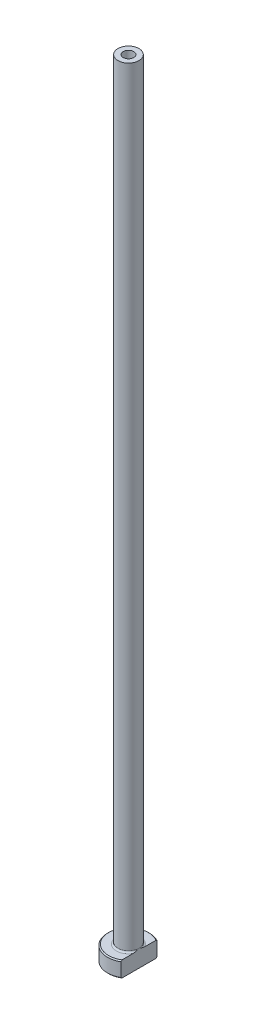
ISO-10303-21;
HEADER;
FILE_DESCRIPTION(('STEP AP214'),'2;1');
FILE_NAME('part.step','',(''),(''),'','','');
FILE_SCHEMA(('AUTOMOTIVE_DESIGN { 1 0 10303 214 1 1 1 1 }'));
ENDSEC;
DATA;
#1=APPLICATION_CONTEXT('core data for automotive mechanical design processes');
#2=APPLICATION_PROTOCOL_DEFINITION('international standard','automotive_design',2000,#1);
#3=PRODUCT_CONTEXT('',#1,'mechanical');
#4=PRODUCT('Part','Part','',(#3));
#5=PRODUCT_RELATED_PRODUCT_CATEGORY('part','',(#4));
#6=PRODUCT_DEFINITION_FORMATION('','',#4);
#7=PRODUCT_DEFINITION_CONTEXT('part definition',#1,'design');
#8=PRODUCT_DEFINITION('design','',#6,#7);
#9=PRODUCT_DEFINITION_SHAPE('','',#8);
#10=(LENGTH_UNIT() NAMED_UNIT(*) SI_UNIT(.MILLI.,.METRE.));
#11=(NAMED_UNIT(*) PLANE_ANGLE_UNIT() SI_UNIT($,.RADIAN.));
#12=(NAMED_UNIT(*) SI_UNIT($,.STERADIAN.) SOLID_ANGLE_UNIT());
#13=UNCERTAINTY_MEASURE_WITH_UNIT(LENGTH_MEASURE(1.E-05),#10,'distance_accuracy_value','');
#14=(GEOMETRIC_REPRESENTATION_CONTEXT(3) GLOBAL_UNCERTAINTY_ASSIGNED_CONTEXT((#13)) GLOBAL_UNIT_ASSIGNED_CONTEXT((#10,
#11,#12)) REPRESENTATION_CONTEXT('',''));
#15=CARTESIAN_POINT('',(0.,0.,0.));
#16=DIRECTION('',(0.,0.,1.));
#17=DIRECTION('',(1.,0.,0.));
#18=AXIS2_PLACEMENT_3D('',#15,#16,#17);
#19=CARTESIAN_POINT('',(0.,92.1876809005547,0.));
#20=DIRECTION('',(0.,1.,0.));
#21=DIRECTION('',(0.,0.,1.));
#22=AXIS2_PLACEMENT_3D('',#19,#20,#21);
#23=CYLINDRICAL_SURFACE('',#22,1.);
#24=CARTESIAN_POINT('',(0.,150.,0.));
#25=DIRECTION('',(0.,1.,0.));
#26=DIRECTION('',(0.,0.,1.));
#27=AXIS2_PLACEMENT_3D('',#24,#25,#26);
#28=CIRCLE('',#27,1.);
#29=CARTESIAN_POINT('',(0.,150.,1.));
#30=VERTEX_POINT('',#29);
#31=EDGE_CURVE('E167',#30,#30,#28,.T.);
#32=ORIENTED_EDGE('',*,*,#31,.T.);
#33=EDGE_LOOP('',(#32));
#34=FACE_BOUND('',#33,.T.);
#35=CARTESIAN_POINT('',(0.,115.,0.));
#36=DIRECTION('',(0.,1.,0.));
#37=DIRECTION('',(0.,0.,1.));
#38=AXIS2_PLACEMENT_3D('',#35,#36,#37);
#39=CIRCLE('',#38,1.);
#40=CARTESIAN_POINT('',(0.,115.,1.));
#41=VERTEX_POINT('',#40);
#42=EDGE_CURVE('E170',#41,#41,#39,.T.);
#43=ORIENTED_EDGE('',*,*,#42,.F.);
#44=EDGE_LOOP('',(#43));
#45=FACE_BOUND('',#44,.T.);
#46=ADVANCED_FACE('F32',(#34,#45),#23,.F.);
#47=CARTESIAN_POINT('',(-1.,150.,0.));
#48=DIRECTION('',(0.,1.,0.));
#49=DIRECTION('',(0.,0.,1.));
#50=AXIS2_PLACEMENT_3D('',#47,#48,#49);
#51=PLANE('',#50);
#52=CARTESIAN_POINT('',(0.,150.,0.));
#53=DIRECTION('',(0.,1.,0.));
#54=DIRECTION('',(0.,0.,1.));
#55=AXIS2_PLACEMENT_3D('',#52,#53,#54);
#56=CIRCLE('',#55,2.00000000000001);
#57=CARTESIAN_POINT('',(0.,150.,2.00000000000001));
#58=VERTEX_POINT('',#57);
#59=EDGE_CURVE('E174',#58,#58,#56,.T.);
#60=ORIENTED_EDGE('',*,*,#59,.T.);
#61=EDGE_LOOP('',(#60));
#62=FACE_BOUND('',#61,.T.);
#63=ORIENTED_EDGE('',*,*,#31,.F.);
#64=EDGE_LOOP('',(#63));
#65=FACE_BOUND('',#64,.T.);
#66=ADVANCED_FACE('F157',(#62,#65),#51,.T.);
#67=CARTESIAN_POINT('',(0.,92.1876809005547,0.));
#68=DIRECTION('',(0.,1.,0.));
#69=DIRECTION('',(0.,0.,1.));
#70=AXIS2_PLACEMENT_3D('',#67,#68,#69);
#71=CYLINDRICAL_SURFACE('',#70,2.);
#72=CARTESIAN_POINT('',(0.,3.3,0.));
#73=DIRECTION('',(0.,1.,0.));
#74=DIRECTION('',(0.,0.,1.));
#75=AXIS2_PLACEMENT_3D('',#72,#73,#74);
#76=CIRCLE('',#75,2.);
#77=CARTESIAN_POINT('',(2.,3.3,0.));
#78=VERTEX_POINT('',#77);
#79=EDGE_CURVE('E180',#78,#78,#76,.T.);
#80=ORIENTED_EDGE('',*,*,#79,.T.);
#81=EDGE_LOOP('',(#80));
#82=FACE_BOUND('',#81,.T.);
#83=ORIENTED_EDGE('',*,*,#59,.F.);
#84=EDGE_LOOP('',(#83));
#85=FACE_BOUND('',#84,.T.);
#86=ADVANCED_FACE('F162',(#82,#85),#71,.T.);
#87=CARTESIAN_POINT('',(-1.99999999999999,3.,0.));
#88=DIRECTION('',(0.,1.,0.));
#89=DIRECTION('',(0.,0.,1.));
#90=AXIS2_PLACEMENT_3D('',#87,#88,#89);
#91=PLANE('',#90);
#92=DIRECTION('',(0.,0.,1.));
#93=VECTOR('',#92,1.);
#94=CARTESIAN_POINT('',(2.,3.,0.));
#95=LINE('',#94,#93);
#96=CARTESIAN_POINT('',(2.,3.,-3.23109888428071));
#97=VERTEX_POINT('',#96);
#98=CARTESIAN_POINT('',(2.,3.,-1.13578166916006));
#99=VERTEX_POINT('',#98);
#100=EDGE_CURVE('E54',#97,#99,#95,.T.);
#101=ORIENTED_EDGE('',*,*,#100,.F.);
#102=CARTESIAN_POINT('',(0.,3.,0.));
#103=DIRECTION('',(0.,1.,0.));
#104=DIRECTION('',(0.,0.,1.));
#105=AXIS2_PLACEMENT_3D('',#102,#103,#104);
#106=CIRCLE('',#105,3.8);
#107=CARTESIAN_POINT('',(1.99999999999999,2.99999999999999,3.23109888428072));
#108=VERTEX_POINT('',#107);
#109=EDGE_CURVE('E186',#97,#108,#106,.T.);
#110=ORIENTED_EDGE('',*,*,#109,.T.);
#111=CARTESIAN_POINT('',(2.,3.,1.13578166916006));
#112=VERTEX_POINT('',#111);
#113=EDGE_CURVE('E134',#112,#108,#95,.T.);
#114=ORIENTED_EDGE('',*,*,#113,.F.);
#115=CARTESIAN_POINT('',(0.,3.,0.));
#116=DIRECTION('',(0.,1.,0.));
#117=DIRECTION('',(0.,0.,1.));
#118=AXIS2_PLACEMENT_3D('',#115,#116,#117);
#119=CIRCLE('',#118,2.3);
#120=EDGE_CURVE('E183',#112,#99,#119,.F.);
#121=ORIENTED_EDGE('',*,*,#120,.T.);
#122=EDGE_LOOP('',(#101,#110,#114,#121));
#123=FACE_BOUND('',#122,.T.);
#124=ADVANCED_FACE('F197',(#123),#91,.T.);
#125=CARTESIAN_POINT('',(0.,92.1876809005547,0.));
#126=DIRECTION('',(0.,1.,0.));
#127=DIRECTION('',(0.,0.,1.));
#128=AXIS2_PLACEMENT_3D('',#125,#126,#127);
#129=CYLINDRICAL_SURFACE('',#128,3.99999999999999);
#130=DIRECTION('',(0.,-1.,0.));
#131=VECTOR('',#130,1.);
#132=CARTESIAN_POINT('',(1.99999999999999,150.,3.46410161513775));
#133=LINE('',#132,#131);
#134=CARTESIAN_POINT('',(1.99999999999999,2.8,3.46410161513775));
#135=VERTEX_POINT('',#134);
#136=CARTESIAN_POINT('',(1.99999999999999,0.20000000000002,3.46410161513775));
#137=VERTEX_POINT('',#136);
#138=EDGE_CURVE('E82',#135,#137,#133,.T.);
#139=ORIENTED_EDGE('',*,*,#138,.F.);
#140=CARTESIAN_POINT('',(0.,2.8,0.));
#141=DIRECTION('',(0.,1.,0.));
#142=DIRECTION('',(0.,0.,1.));
#143=AXIS2_PLACEMENT_3D('',#140,#141,#142);
#144=CIRCLE('',#143,3.99999999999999);
#145=CARTESIAN_POINT('',(2.,2.8,-3.46410161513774));
#146=VERTEX_POINT('',#145);
#147=EDGE_CURVE('E95',#135,#146,#144,.F.);
#148=ORIENTED_EDGE('',*,*,#147,.T.);
#149=DIRECTION('',(0.,-1.,0.));
#150=VECTOR('',#149,1.);
#151=CARTESIAN_POINT('',(2.,150.,-3.46410161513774));
#152=LINE('',#151,#150);
#153=CARTESIAN_POINT('',(2.,0.20000000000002,-3.46410161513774));
#154=VERTEX_POINT('',#153);
#155=EDGE_CURVE('E192',#146,#154,#152,.T.);
#156=ORIENTED_EDGE('',*,*,#155,.T.);
#157=CARTESIAN_POINT('',(0.,0.20000000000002,0.));
#158=DIRECTION('',(0.,-1.,0.));
#159=DIRECTION('',(0.,0.,-1.));
#160=AXIS2_PLACEMENT_3D('',#157,#158,#159);
#161=CIRCLE('',#160,3.99999999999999);
#162=EDGE_CURVE('E98',#154,#137,#161,.F.);
#163=ORIENTED_EDGE('',*,*,#162,.T.);
#164=EDGE_LOOP('',(#139,#148,#156,#163));
#165=FACE_BOUND('',#164,.T.);
#166=ADVANCED_FACE('F190',(#165),#129,.T.);
#167=CARTESIAN_POINT('',(-3.99999999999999,0.,0.));
#168=DIRECTION('',(0.,-1.,0.));
#169=DIRECTION('',(0.,0.,-1.));
#170=AXIS2_PLACEMENT_3D('',#167,#168,#169);
#171=PLANE('',#170);
#172=CARTESIAN_POINT('',(0.,0.,0.));
#173=DIRECTION('',(0.,-1.,0.));
#174=DIRECTION('',(0.,0.,-1.));
#175=AXIS2_PLACEMENT_3D('',#172,#173,#174);
#176=CIRCLE('',#175,1.74999999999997);
#177=CARTESIAN_POINT('',(0.,0.,-1.74999999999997));
#178=VERTEX_POINT('',#177);
#179=EDGE_CURVE('E40',#178,#178,#176,.F.);
#180=ORIENTED_EDGE('',*,*,#179,.T.);
#181=EDGE_LOOP('',(#180));
#182=FACE_BOUND('',#181,.T.);
#183=DIRECTION('',(0.,0.,-1.));
#184=VECTOR('',#183,1.);
#185=CARTESIAN_POINT('',(1.99999999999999,0.,3.46410161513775));
#186=LINE('',#185,#184);
#187=CARTESIAN_POINT('',(1.99999999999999,0.,3.23109888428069));
#188=VERTEX_POINT('',#187);
#189=CARTESIAN_POINT('',(2.,0.,-3.23109888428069));
#190=VERTEX_POINT('',#189);
#191=EDGE_CURVE('E47',#188,#190,#186,.T.);
#192=ORIENTED_EDGE('',*,*,#191,.F.);
#193=CARTESIAN_POINT('',(0.,0.,0.));
#194=DIRECTION('',(0.,-1.,0.));
#195=DIRECTION('',(0.,0.,-1.));
#196=AXIS2_PLACEMENT_3D('',#193,#194,#195);
#197=CIRCLE('',#196,3.79999999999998);
#198=EDGE_CURVE('E92',#188,#190,#197,.T.);
#199=ORIENTED_EDGE('',*,*,#198,.T.);
#200=EDGE_LOOP('',(#192,#199));
#201=FACE_BOUND('',#200,.T.);
#202=ADVANCED_FACE('F91',(#182,#201),#171,.T.);
#203=CARTESIAN_POINT('',(0.,92.1876809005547,0.));
#204=DIRECTION('',(0.,1.,0.));
#205=DIRECTION('',(0.,0.,1.));
#206=AXIS2_PLACEMENT_3D('',#203,#204,#205);
#207=CYLINDRICAL_SURFACE('',#206,1.25);
#208=CARTESIAN_POINT('',(0.,0.499999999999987,0.));
#209=DIRECTION('',(0.,-1.,0.));
#210=DIRECTION('',(0.,0.,-1.));
#211=AXIS2_PLACEMENT_3D('',#208,#209,#210);
#212=CIRCLE('',#211,1.25);
#213=CARTESIAN_POINT('',(0.,0.499999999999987,-1.25));
#214=VERTEX_POINT('',#213);
#215=EDGE_CURVE('E11',#214,#214,#212,.T.);
#216=ORIENTED_EDGE('',*,*,#215,.T.);
#217=EDGE_LOOP('',(#216));
#218=FACE_BOUND('',#217,.T.);
#219=CARTESIAN_POINT('',(0.,103.,0.));
#220=DIRECTION('',(0.,1.,0.));
#221=DIRECTION('',(0.,0.,1.));
#222=AXIS2_PLACEMENT_3D('',#219,#220,#221);
#223=CIRCLE('',#222,1.25);
#224=CARTESIAN_POINT('',(0.,103.,1.25));
#225=VERTEX_POINT('',#224);
#226=EDGE_CURVE('E172',#225,#225,#223,.T.);
#227=ORIENTED_EDGE('',*,*,#226,.T.);
#228=EDGE_LOOP('',(#227));
#229=FACE_BOUND('',#228,.T.);
#230=ADVANCED_FACE('F215',(#218,#229),#207,.F.);
#231=CARTESIAN_POINT('',(0.,103.,0.));
#232=DIRECTION('',(0.,-1.,0.));
#233=DIRECTION('',(0.,0.,-1.));
#234=AXIS2_PLACEMENT_3D('',#231,#232,#233);
#235=CONICAL_SURFACE('',#234,1.25,0.0208303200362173);
#236=ORIENTED_EDGE('',*,*,#42,.T.);
#237=EDGE_LOOP('',(#236));
#238=FACE_BOUND('',#237,.T.);
#239=ORIENTED_EDGE('',*,*,#226,.F.);
#240=EDGE_LOOP('',(#239));
#241=FACE_BOUND('',#240,.T.);
#242=ADVANCED_FACE('F111',(#238,#241),#235,.F.);
#243=CARTESIAN_POINT('',(0.,3.3,0.));
#244=DIRECTION('',(0.,1.,0.));
#245=DIRECTION('',(0.,0.,1.));
#246=AXIS2_PLACEMENT_3D('',#243,#244,#245);
#247=TOROIDAL_SURFACE('',#246,2.3,0.3);
#248=ORIENTED_EDGE('',*,*,#120,.F.);
#249=CARTESIAN_POINT('',(2.,3.3,0.));
#250=CARTESIAN_POINT('',(2.,3.30000062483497,7.9112423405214E-11));
#251=CARTESIAN_POINT('',(2.,3.30000124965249,1.38466992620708E-07));
#252=CARTESIAN_POINT('',(2.,3.30000244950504,5.72507163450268E-07));
#253=CARTESIAN_POINT('',(2.,3.30000302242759,8.72849078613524E-07));
#254=CARTESIAN_POINT('',(2.,3.30000416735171,1.59335960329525E-06));
#255=CARTESIAN_POINT('',(2.,3.30000473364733,2.02244717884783E-06));
#256=CARTESIAN_POINT('',(2.,3.30000579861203,2.94494876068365E-06));
#257=CARTESIAN_POINT('',(2.,3.30000629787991,3.43770341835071E-06));
#258=CARTESIAN_POINT('',(2.,3.30000798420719,5.21460121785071E-06));
#259=CARTESIAN_POINT('',(2.,3.30000908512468,6.58180971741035E-06));
#260=CARTESIAN_POINT('',(2.,3.30001103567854,9.39775396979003E-06));
#261=CARTESIAN_POINT('',(2.,3.30001189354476,1.08411108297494E-05));
#262=CARTESIAN_POINT('',(2.,3.30001514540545,1.65122787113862E-05));
#263=CARTESIAN_POINT('',(2.,3.30001737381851,2.08398798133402E-05));
#264=CARTESIAN_POINT('',(2.,3.30002099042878,2.93440781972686E-05));
#265=CARTESIAN_POINT('',(2.,3.30002243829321,3.34960315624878E-05));
#266=CARTESIAN_POINT('',(2.,3.30002863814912,5.12890602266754E-05));
#267=CARTESIAN_POINT('',(2.,3.30003337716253,6.49250975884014E-05));
#268=CARTESIAN_POINT('',(1.99999999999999,3.3000409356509,9.03829873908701E-05));
#269=CARTESIAN_POINT('',(1.99999999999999,3.30004394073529,0.000102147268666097));
#270=CARTESIAN_POINT('',(2.,3.30006787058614,0.000188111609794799));
#271=CARTESIAN_POINT('',(2.,3.30009855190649,0.000259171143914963));
#272=CARTESIAN_POINT('',(1.99999999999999,3.30021378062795,0.000536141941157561));
#273=CARTESIAN_POINT('',(1.99999999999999,3.30029106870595,0.000744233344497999));
#274=CARTESIAN_POINT('',(2.,3.30059644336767,0.00155446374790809));
#275=CARTESIAN_POINT('',(2.,3.30083214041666,0.00215436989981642));
#276=CARTESIAN_POINT('',(1.99999999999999,3.30179425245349,0.00461477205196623));
#277=CARTESIAN_POINT('',(1.99999999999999,3.30251207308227,0.00647773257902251));
#278=CARTESIAN_POINT('',(2.,3.31311632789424,0.0339840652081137));
#279=CARTESIAN_POINT('',(2.,3.32306890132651,0.0596088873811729));
#280=CARTESIAN_POINT('',(1.99999999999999,3.34248629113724,0.109946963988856));
#281=CARTESIAN_POINT('',(1.99999999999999,3.35195547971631,0.134658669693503));
#282=CARTESIAN_POINT('',(2.,3.37186796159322,0.187046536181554));
#283=CARTESIAN_POINT('',(1.99999999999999,3.38229466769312,0.214729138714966));
#284=CARTESIAN_POINT('',(1.99999999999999,3.40297705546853,0.27048073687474));
#285=CARTESIAN_POINT('',(1.99999999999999,3.41322989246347,0.298550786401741));
#286=CARTESIAN_POINT('',(1.99999999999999,3.43806738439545,0.368007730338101));
#287=CARTESIAN_POINT('',(1.99999999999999,3.45243182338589,0.409474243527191));
#288=CARTESIAN_POINT('',(1.99999999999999,3.47965482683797,0.491807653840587));
#289=CARTESIAN_POINT('',(1.99999999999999,3.49254110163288,0.532665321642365));
#290=CARTESIAN_POINT('',(1.99999999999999,3.51851192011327,0.620554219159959));
#291=CARTESIAN_POINT('',(1.99999999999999,3.53137383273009,0.66765229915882));
#292=CARTESIAN_POINT('',(1.99999999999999,3.55459547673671,0.762854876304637));
#293=CARTESIAN_POINT('',(1.99999999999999,3.56493539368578,0.810964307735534));
#294=CARTESIAN_POINT('',(1.99999999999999,3.5827095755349,0.910933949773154));
#295=CARTESIAN_POINT('',(1.99999999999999,3.58991426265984,0.962836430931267));
#296=CARTESIAN_POINT('',(1.99999999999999,3.59906919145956,1.06698400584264));
#297=CARTESIAN_POINT('',(1.99999999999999,3.60103790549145,1.11922724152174));
#298=CARTESIAN_POINT('',(1.99999999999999,3.59819318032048,1.21399009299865));
#299=CARTESIAN_POINT('',(1.99999999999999,3.59455548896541,1.25653871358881));
#300=CARTESIAN_POINT('',(1.99999999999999,3.58116512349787,1.34017723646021));
#301=CARTESIAN_POINT('',(1.99999999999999,3.57150205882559,1.38127935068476));
#302=CARTESIAN_POINT('',(1.99999999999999,3.55087659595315,1.44109771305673));
#303=CARTESIAN_POINT('',(1.99999999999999,3.54291246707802,1.46084510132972));
#304=CARTESIAN_POINT('',(1.99999999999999,3.52453399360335,1.49924523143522));
#305=CARTESIAN_POINT('',(1.99999999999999,3.5141153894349,1.51789599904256));
#306=CARTESIAN_POINT('',(1.99999999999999,3.49255299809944,1.55022658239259));
#307=CARTESIAN_POINT('',(1.99999999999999,3.48185951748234,1.56420357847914));
#308=CARTESIAN_POINT('',(1.99999999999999,3.45839348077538,1.59028758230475));
#309=CARTESIAN_POINT('',(1.99999999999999,3.4456258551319,1.60239889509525));
#310=CARTESIAN_POINT('',(1.99999999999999,3.4218327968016,1.6209342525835));
#311=CARTESIAN_POINT('',(1.99999999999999,3.41131183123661,1.6280029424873));
#312=CARTESIAN_POINT('',(1.99999999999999,3.38926242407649,1.6403613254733));
#313=CARTESIAN_POINT('',(1.99999999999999,3.37773458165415,1.64565206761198));
#314=CARTESIAN_POINT('',(1.99999999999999,3.35379760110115,1.6541096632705));
#315=CARTESIAN_POINT('',(1.99999999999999,3.34138166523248,1.65725762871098));
#316=CARTESIAN_POINT('',(1.99999999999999,3.31617371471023,1.66106000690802));
#317=CARTESIAN_POINT('',(1.99999999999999,3.30338200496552,1.66171638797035));
#318=CARTESIAN_POINT('',(1.99999999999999,3.27959278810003,1.6605584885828));
#319=CARTESIAN_POINT('',(1.99999999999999,3.26857876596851,1.6590551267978));
#320=CARTESIAN_POINT('',(1.99999999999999,3.24695777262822,1.65423593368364));
#321=CARTESIAN_POINT('',(1.99999999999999,3.2363508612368,1.65091983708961));
#322=CARTESIAN_POINT('',(1.99999999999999,3.21566894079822,1.64264699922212));
#323=CARTESIAN_POINT('',(1.99999999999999,3.20560117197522,1.63767239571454));
#324=CARTESIAN_POINT('',(1.99999999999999,3.18626855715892,1.62636415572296));
#325=CARTESIAN_POINT('',(1.99999999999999,3.1770040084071,1.62003001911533));
#326=CARTESIAN_POINT('',(1.99999999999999,3.15429988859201,1.60233802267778));
#327=CARTESIAN_POINT('',(1.99999999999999,3.14148777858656,1.59017362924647));
#328=CARTESIAN_POINT('',(1.99999999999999,3.11794267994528,1.56396532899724));
#329=CARTESIAN_POINT('',(1.99999999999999,3.1072162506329,1.54991572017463));
#330=CARTESIAN_POINT('',(1.99999999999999,3.08234423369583,1.51253200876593));
#331=CARTESIAN_POINT('',(1.99999999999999,3.06952968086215,1.4883171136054));
#332=CARTESIAN_POINT('',(1.99999999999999,3.04773953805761,1.43832020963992));
#333=CARTESIAN_POINT('',(1.99999999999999,3.0387619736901,1.41253901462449));
#334=CARTESIAN_POINT('',(1.99999999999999,3.01850750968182,1.34101817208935));
#335=CARTESIAN_POINT('',(1.99999999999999,3.01031623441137,1.2944149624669));
#336=CARTESIAN_POINT('',(1.99999999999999,3.00061264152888,1.19993212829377));
#337=CARTESIAN_POINT('',(1.99999999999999,2.99920833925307,1.15204398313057));
#338=CARTESIAN_POINT('',(1.99999999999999,3.00193088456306,1.04246961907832));
#339=CARTESIAN_POINT('',(1.99999999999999,3.00779200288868,0.980836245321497));
#340=CARTESIAN_POINT('',(1.99999999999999,3.02562921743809,0.858294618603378));
#341=CARTESIAN_POINT('',(1.99999999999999,3.03763032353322,0.797390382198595));
#342=CARTESIAN_POINT('',(1.99999999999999,3.06494905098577,0.681046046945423));
#343=CARTESIAN_POINT('',(1.99999999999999,3.07996031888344,0.625531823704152));
#344=CARTESIAN_POINT('',(1.99999999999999,3.1125008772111,0.515805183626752));
#345=CARTESIAN_POINT('',(1.99999999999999,3.13000629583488,0.461585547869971));
#346=CARTESIAN_POINT('',(1.99999999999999,3.15814737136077,0.379074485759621));
#347=CARTESIAN_POINT('',(1.99999999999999,3.16814918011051,0.350562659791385));
#348=CARTESIAN_POINT('',(1.99999999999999,3.18879761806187,0.292954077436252));
#349=CARTESIAN_POINT('',(1.99999999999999,3.19945417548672,0.263860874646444));
#350=CARTESIAN_POINT('',(1.99999999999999,3.21767622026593,0.2148696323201));
#351=CARTESIAN_POINT('',(1.99999999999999,3.22516548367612,0.194943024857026));
#352=CARTESIAN_POINT('',(1.99999999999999,3.24017206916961,0.15532752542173));
#353=CARTESIAN_POINT('',(1.99999999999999,3.2476883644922,0.135638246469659));
#354=CARTESIAN_POINT('',(1.99999999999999,3.26198776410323,0.0983447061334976));
#355=CARTESIAN_POINT('',(1.99999999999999,3.26876515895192,0.0807381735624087));
#356=CARTESIAN_POINT('',(1.99999999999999,3.28263254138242,0.0448719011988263));
#357=CARTESIAN_POINT('',(1.99999999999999,3.28972459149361,0.0266128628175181));
#358=CARTESIAN_POINT('',(1.99999999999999,3.29748742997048,0.00647923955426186));
#359=CARTESIAN_POINT('',(1.99999999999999,3.2982046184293,0.00461774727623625));
#360=CARTESIAN_POINT('',(1.99999999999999,3.29916656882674,0.00215769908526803));
#361=CARTESIAN_POINT('',(1.99999999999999,3.29940270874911,0.00155667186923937));
#362=CARTESIAN_POINT('',(1.99999999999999,3.29970861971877,0.00074501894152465));
#363=CARTESIAN_POINT('',(1.99999999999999,3.29978601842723,0.000536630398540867));
#364=CARTESIAN_POINT('',(1.99999999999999,3.29990139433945,0.000259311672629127));
#365=CARTESIAN_POINT('',(1.99999999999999,3.29993209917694,0.000188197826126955));
#366=CARTESIAN_POINT('',(1.99999999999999,3.29995604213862,0.000102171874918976));
#367=CARTESIAN_POINT('',(1.99999999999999,3.29995904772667,9.04035989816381E-05));
#368=CARTESIAN_POINT('',(1.99999999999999,3.29996660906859,6.49368799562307E-05));
#369=CARTESIAN_POINT('',(1.99999999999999,3.29997135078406,5.12961159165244E-05));
#370=CARTESIAN_POINT('',(2.,3.29997755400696,3.34977867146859E-05));
#371=CARTESIAN_POINT('',(2.,3.29997900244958,2.93452196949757E-05));
#372=CARTESIAN_POINT('',(2.,3.29998262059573,2.08398582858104E-05));
#373=CARTESIAN_POINT('',(2.,3.29998485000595,1.65117310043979E-05));
#374=CARTESIAN_POINT('',(2.,3.29998810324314,1.08400643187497E-05));
#375=CARTESIAN_POINT('',(2.,3.29998896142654,9.39665975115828E-06));
#376=CARTESIAN_POINT('',(2.,3.29999091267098,6.58068248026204E-06));
#377=CARTESIAN_POINT('',(2.,3.29999201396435,5.21349211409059E-06));
#378=CARTESIAN_POINT('',(2.,3.29999370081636,3.43669369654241E-06));
#379=CARTESIAN_POINT('',(2.,3.29999420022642,2.94398259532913E-06));
#380=CARTESIAN_POINT('',(2.,3.29999526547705,2.02159363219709E-06));
#381=CARTESIAN_POINT('',(2.,3.29999583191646,1.5925754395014E-06));
#382=CARTESIAN_POINT('',(2.,3.29999697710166,8.72232508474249E-07));
#383=CARTESIAN_POINT('',(2.,3.29999755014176,5.71985143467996E-07));
#384=CARTESIAN_POINT('',(2.,3.29999875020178,1.38175062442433E-07));
#385=CARTESIAN_POINT('',(2.,3.29999937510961,-7.91189385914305E-11));
#386=CARTESIAN_POINT('',(2.,3.3,0.));
#387=B_SPLINE_CURVE_WITH_KNOTS('',3,(#249,#250,#251,#252,#253,#254,#255,#256,#257,#258,#259,
#260,#261,#262,#263,#264,#265,#266,#267,#268,#269,#270,#271,#272,#273,#274,#275,#276,#277,#278,
#279,#280,#281,#282,#283,#284,#285,#286,#287,#288,#289,#290,#291,#292,#293,#294,#295,#296,#297,
#298,#299,#300,#301,#302,#303,#304,#305,#306,#307,#308,#309,#310,#311,#312,#313,#314,#315,#316,
#317,#318,#319,#320,#321,#322,#323,#324,#325,#326,#327,#328,#329,#330,#331,#332,#333,#334,#335,
#336,#337,#338,#339,#340,#341,#342,#343,#344,#345,#346,#347,#348,#349,#350,#351,#352,#353,#354,
#355,#356,#357,#358,#359,#360,#361,#362,#363,#364,#365,#366,#367,#368,#369,#370,#371,#372,#373,
#374,#375,#376,#377,#378,#379,#380,#381,#382,#383,#384,#385,#386),.UNSPECIFIED.,.T.,.F.,(4,2,2,
2,2,2,2,2,2,2,2,2,2,2,2,2,2,2,2,2,2,2,2,2,2,2,2,2,2,2,2,2,2,2,2,2,2,2,2,2,2,2,2,2,2,2,2,2,2,2,2,
2,2,2,2,2,2,2,2,2,2,2,2,2,2,2,2,2,4),(0.,1.8739221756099E-06,3.80527345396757E-06,
5.92782129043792E-06,8.02992627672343E-06,1.32707935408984E-05,1.83039454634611E-05,
3.28629492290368E-05,4.60403087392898E-05,8.93409863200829E-05,0.000125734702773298,
0.000357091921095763,0.00102372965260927,0.00295649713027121,0.00894682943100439,
0.0914075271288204,0.170800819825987,0.259542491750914,0.349192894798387,0.480831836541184,
0.609336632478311,0.755749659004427,0.903278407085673,1.06029304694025,1.21675300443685,
1.34456674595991,1.47052354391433,1.53427785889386,1.59814364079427,1.65076980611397,
1.7032726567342,1.74115950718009,1.77902396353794,1.81721800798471,1.85538187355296,
1.88857073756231,1.92176445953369,1.95532789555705,1.98890369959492,2.0416028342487,
2.09446511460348,2.17619131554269,2.25787541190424,2.39903747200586,2.5424389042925,
2.72770087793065,2.91372355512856,3.08615579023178,3.25703652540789,3.34768022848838,
3.4406279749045,3.50449043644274,3.56771526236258,3.62431442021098,3.68307253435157,
3.68905809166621,3.69099447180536,3.69166206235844,3.69189359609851,3.69193000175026,
3.6919733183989,3.69198649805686,3.69200105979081,3.69200609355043,3.69201133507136,
3.69201343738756,3.6920155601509,3.69201749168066,3.69201936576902),.UNSPECIFIED.);
#388=EDGE_CURVE('E126',#112,#78,#387,.T.);
#389=ORIENTED_EDGE('',*,*,#388,.T.);
#390=ORIENTED_EDGE('',*,*,#79,.F.);
#391=CARTESIAN_POINT('',(2.,3.3,0.));
#392=CARTESIAN_POINT('',(2.,3.29999937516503,-7.91119192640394E-11));
#393=CARTESIAN_POINT('',(2.,3.2999987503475,-1.38466992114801E-07));
#394=CARTESIAN_POINT('',(2.,3.29999755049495,-5.72507162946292E-07));
#395=CARTESIAN_POINT('',(2.,3.29999697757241,-8.72849078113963E-07));
#396=CARTESIAN_POINT('',(2.,3.29999583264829,-1.59335960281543E-06));
#397=CARTESIAN_POINT('',(2.,3.29999526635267,-2.02244717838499E-06));
#398=CARTESIAN_POINT('',(2.,3.29999420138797,-2.94494876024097E-06));
#399=CARTESIAN_POINT('',(2.,3.29999370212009,-3.43770341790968E-06));
#400=CARTESIAN_POINT('',(2.,3.29999201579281,-5.2146012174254E-06));
#401=CARTESIAN_POINT('',(2.,3.29999091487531,-6.58180971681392E-06));
#402=CARTESIAN_POINT('',(2.,3.29998896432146,-9.39775396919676E-06));
#403=CARTESIAN_POINT('',(2.,3.29998810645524,-1.08411108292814E-05));
#404=CARTESIAN_POINT('',(2.,3.29998485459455,-1.6512278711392E-05));
#405=CARTESIAN_POINT('',(2.,3.29998262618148,-2.08398798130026E-05));
#406=CARTESIAN_POINT('',(2.,3.29997900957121,-2.93440781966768E-05));
#407=CARTESIAN_POINT('',(2.,3.29997756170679,-3.34960315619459E-05));
#408=CARTESIAN_POINT('',(1.99999999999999,3.29997136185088,-5.12890602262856E-05));
#409=CARTESIAN_POINT('',(1.99999999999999,3.29996662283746,-6.49250975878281E-05));
#410=CARTESIAN_POINT('',(1.99999999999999,3.29995906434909,-9.03829873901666E-05));
#411=CARTESIAN_POINT('',(1.99999999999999,3.2999560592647,-0.00010214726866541));
#412=CARTESIAN_POINT('',(1.99999999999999,3.29993212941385,-0.000188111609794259));
#413=CARTESIAN_POINT('',(1.99999999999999,3.29990144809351,-0.000259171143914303));
#414=CARTESIAN_POINT('',(1.99999999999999,3.29978621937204,-0.000536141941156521));
#415=CARTESIAN_POINT('',(1.99999999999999,3.29970893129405,-0.000744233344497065));
#416=CARTESIAN_POINT('',(1.99999999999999,3.29940355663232,-0.00155446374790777));
#417=CARTESIAN_POINT('',(1.99999999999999,3.29916785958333,-0.00215436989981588));
#418=CARTESIAN_POINT('',(1.99999999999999,3.2982057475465,-0.00461477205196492));
#419=CARTESIAN_POINT('',(1.99999999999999,3.29748792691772,-0.00647773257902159));
#420=CARTESIAN_POINT('',(1.99999999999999,3.28688367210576,-0.0339840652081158));
#421=CARTESIAN_POINT('',(1.99999999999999,3.27693109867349,-0.0596088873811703));
#422=CARTESIAN_POINT('',(2.,3.25751370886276,-0.109946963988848));
#423=CARTESIAN_POINT('',(1.99999999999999,3.24804452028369,-0.134658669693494));
#424=CARTESIAN_POINT('',(1.99999999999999,3.22813203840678,-0.187046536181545));
#425=CARTESIAN_POINT('',(1.99999999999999,3.21770533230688,-0.214729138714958));
#426=CARTESIAN_POINT('',(1.99999999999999,3.19702294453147,-0.270480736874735));
#427=CARTESIAN_POINT('',(1.99999999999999,3.18677010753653,-0.298550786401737));
#428=CARTESIAN_POINT('',(1.99999999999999,3.16193261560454,-0.3680077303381));
#429=CARTESIAN_POINT('',(1.99999999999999,3.14756817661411,-0.40947424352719));
#430=CARTESIAN_POINT('',(1.99999999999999,3.12034517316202,-0.491807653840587));
#431=CARTESIAN_POINT('',(1.99999999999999,3.10745889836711,-0.532665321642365));
#432=CARTESIAN_POINT('',(1.99999999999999,3.08148807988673,-0.620554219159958));
#433=CARTESIAN_POINT('',(1.99999999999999,3.06862616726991,-0.667652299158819));
#434=CARTESIAN_POINT('',(1.99999999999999,3.04540452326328,-0.762854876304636));
#435=CARTESIAN_POINT('',(1.99999999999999,3.03506460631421,-0.810964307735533));
#436=CARTESIAN_POINT('',(1.99999999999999,3.0172904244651,-0.910933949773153));
#437=CARTESIAN_POINT('',(1.99999999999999,3.01008573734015,-0.962836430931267));
#438=CARTESIAN_POINT('',(1.99999999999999,3.00093080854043,-1.06698400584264));
#439=CARTESIAN_POINT('',(1.99999999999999,2.99896209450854,-1.11922724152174));
#440=CARTESIAN_POINT('',(1.99999999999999,3.00180681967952,-1.21399009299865));
#441=CARTESIAN_POINT('',(1.99999999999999,3.00544451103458,-1.25653871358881));
#442=CARTESIAN_POINT('',(1.99999999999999,3.01883487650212,-1.34017723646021));
#443=CARTESIAN_POINT('',(1.99999999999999,3.02849794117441,-1.38127935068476));
#444=CARTESIAN_POINT('',(1.99999999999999,3.04912340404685,-1.44109771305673));
#445=CARTESIAN_POINT('',(1.99999999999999,3.05708753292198,-1.46084510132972));
#446=CARTESIAN_POINT('',(1.99999999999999,3.07546600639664,-1.49924523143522));
#447=CARTESIAN_POINT('',(1.99999999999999,3.08588461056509,-1.51789599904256));
#448=CARTESIAN_POINT('',(1.99999999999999,3.10744700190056,-1.55022658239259));
#449=CARTESIAN_POINT('',(1.99999999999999,3.11814048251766,-1.56420357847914));
#450=CARTESIAN_POINT('',(1.99999999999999,3.14160651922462,-1.59028758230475));
#451=CARTESIAN_POINT('',(1.99999999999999,3.1543741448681,-1.60239889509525));
#452=CARTESIAN_POINT('',(1.99999999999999,3.17816720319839,-1.6209342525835));
#453=CARTESIAN_POINT('',(1.99999999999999,3.18868816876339,-1.6280029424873));
#454=CARTESIAN_POINT('',(1.99999999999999,3.2107375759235,-1.6403613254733));
#455=CARTESIAN_POINT('',(1.99999999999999,3.22226541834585,-1.64565206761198));
#456=CARTESIAN_POINT('',(1.99999999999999,3.24620239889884,-1.6541096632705));
#457=CARTESIAN_POINT('',(1.99999999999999,3.25861833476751,-1.65725762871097));
#458=CARTESIAN_POINT('',(1.99999999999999,3.28382628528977,-1.66106000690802));
#459=CARTESIAN_POINT('',(1.99999999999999,3.29661799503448,-1.66171638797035));
#460=CARTESIAN_POINT('',(1.99999999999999,3.32040721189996,-1.66055848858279));
#461=CARTESIAN_POINT('',(1.99999999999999,3.33142123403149,-1.6590551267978));
#462=CARTESIAN_POINT('',(1.99999999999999,3.35304222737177,-1.65423593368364));
#463=CARTESIAN_POINT('',(1.99999999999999,3.36364913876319,-1.65091983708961));
#464=CARTESIAN_POINT('',(1.99999999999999,3.38433105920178,-1.64264699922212));
#465=CARTESIAN_POINT('',(1.99999999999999,3.39439882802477,-1.63767239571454));
#466=CARTESIAN_POINT('',(1.99999999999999,3.41373144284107,-1.62636415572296));
#467=CARTESIAN_POINT('',(1.99999999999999,3.42299599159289,-1.62003001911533));
#468=CARTESIAN_POINT('',(1.99999999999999,3.44570011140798,-1.60233802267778));
#469=CARTESIAN_POINT('',(1.99999999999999,3.45851222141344,-1.59017362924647));
#470=CARTESIAN_POINT('',(1.99999999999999,3.48205732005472,-1.56396532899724));
#471=CARTESIAN_POINT('',(1.99999999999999,3.4927837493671,-1.54991572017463));
#472=CARTESIAN_POINT('',(1.99999999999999,3.51765576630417,-1.51253200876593));
#473=CARTESIAN_POINT('',(1.99999999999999,3.53047031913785,-1.4883171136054));
#474=CARTESIAN_POINT('',(1.99999999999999,3.55226046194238,-1.43832020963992));
#475=CARTESIAN_POINT('',(1.99999999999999,3.56123802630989,-1.41253901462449));
#476=CARTESIAN_POINT('',(1.99999999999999,3.58149249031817,-1.34101817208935));
#477=CARTESIAN_POINT('',(1.99999999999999,3.58968376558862,-1.2944149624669));
#478=CARTESIAN_POINT('',(1.99999999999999,3.59938735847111,-1.19993212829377));
#479=CARTESIAN_POINT('',(1.99999999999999,3.60079166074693,-1.15204398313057));
#480=CARTESIAN_POINT('',(1.99999999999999,3.59806911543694,-1.04246961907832));
#481=CARTESIAN_POINT('',(1.99999999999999,3.59220799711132,-0.980836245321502));
#482=CARTESIAN_POINT('',(1.99999999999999,3.5743707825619,-0.858294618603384));
#483=CARTESIAN_POINT('',(1.99999999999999,3.56236967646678,-0.797390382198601));
#484=CARTESIAN_POINT('',(1.99999999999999,3.53505094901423,-0.681046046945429));
#485=CARTESIAN_POINT('',(1.99999999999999,3.52003968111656,-0.625531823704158));
#486=CARTESIAN_POINT('',(1.99999999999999,3.4874991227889,-0.515805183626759));
#487=CARTESIAN_POINT('',(1.99999999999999,3.46999370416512,-0.461585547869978));
#488=CARTESIAN_POINT('',(1.99999999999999,3.44185262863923,-0.379074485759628));
#489=CARTESIAN_POINT('',(1.99999999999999,3.43185081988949,-0.350562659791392));
#490=CARTESIAN_POINT('',(1.99999999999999,3.41120238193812,-0.292954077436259));
#491=CARTESIAN_POINT('',(1.99999999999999,3.40054582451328,-0.263860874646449));
#492=CARTESIAN_POINT('',(1.99999999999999,3.38232377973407,-0.214869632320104));
#493=CARTESIAN_POINT('',(1.99999999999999,3.37483451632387,-0.19494302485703));
#494=CARTESIAN_POINT('',(1.99999999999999,3.35982793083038,-0.15532752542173));
#495=CARTESIAN_POINT('',(2.,3.3523116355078,-0.135638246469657));
#496=CARTESIAN_POINT('',(1.99999999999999,3.33801223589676,-0.0983447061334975));
#497=CARTESIAN_POINT('',(1.99999999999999,3.33123484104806,-0.0807381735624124));
#498=CARTESIAN_POINT('',(2.,3.3173674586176,-0.0448719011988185));
#499=CARTESIAN_POINT('',(2.,3.31027540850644,-0.0266128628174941));
#500=CARTESIAN_POINT('',(1.99999999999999,3.30251257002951,-0.00647923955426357));
#501=CARTESIAN_POINT('',(1.99999999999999,3.30179538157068,-0.00461774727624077));
#502=CARTESIAN_POINT('',(2.,3.30083343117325,-0.0021576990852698));
#503=CARTESIAN_POINT('',(2.,3.30059729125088,-0.00155667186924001));
#504=CARTESIAN_POINT('',(1.99999999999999,3.30029138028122,-0.000745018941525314));
#505=CARTESIAN_POINT('',(1.99999999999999,3.30021398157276,-0.000536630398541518));
#506=CARTESIAN_POINT('',(2.,3.30009860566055,-0.000259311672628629));
#507=CARTESIAN_POINT('',(2.,3.30006790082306,-0.000188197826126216));
#508=CARTESIAN_POINT('',(1.99999999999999,3.30004395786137,-0.00010217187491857));
#509=CARTESIAN_POINT('',(1.99999999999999,3.30004095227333,-9.04035989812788E-05));
#510=CARTESIAN_POINT('',(2.,3.3000333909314,-6.49368799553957E-05));
#511=CARTESIAN_POINT('',(2.,3.30002864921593,-5.12961159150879E-05));
#512=CARTESIAN_POINT('',(2.,3.30002244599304,-3.34977867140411E-05));
#513=CARTESIAN_POINT('',(2.,3.30002099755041,-2.93452196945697E-05));
#514=CARTESIAN_POINT('',(2.,3.30001737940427,-2.08398582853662E-05));
#515=CARTESIAN_POINT('',(2.,3.30001514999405,-1.65117310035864E-05));
#516=CARTESIAN_POINT('',(2.,3.30001189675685,-1.08400643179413E-05));
#517=CARTESIAN_POINT('',(2.,3.30001103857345,-9.39665975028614E-06));
#518=CARTESIAN_POINT('',(2.,3.30000908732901,-6.58068247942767E-06));
#519=CARTESIAN_POINT('',(2.,3.30000798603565,-5.21349211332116E-06));
#520=CARTESIAN_POINT('',(2.,3.30000629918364,-3.43669369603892E-06));
#521=CARTESIAN_POINT('',(2.,3.30000579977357,-2.94398259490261E-06));
#522=CARTESIAN_POINT('',(2.,3.30000473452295,-2.02159363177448E-06));
#523=CARTESIAN_POINT('',(2.,3.30000416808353,-1.59257543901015E-06));
#524=CARTESIAN_POINT('',(2.,3.30000302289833,-8.72232507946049E-07));
#525=CARTESIAN_POINT('',(2.,3.30000244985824,-5.71985142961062E-07));
#526=CARTESIAN_POINT('',(2.,3.30000124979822,-1.38175061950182E-07));
#527=CARTESIAN_POINT('',(2.,3.30000062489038,7.91194359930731E-11));
#528=CARTESIAN_POINT('',(2.,3.3,0.));
#529=B_SPLINE_CURVE_WITH_KNOTS('',3,(#391,#392,#393,#394,#395,#396,#397,#398,#399,#400,#401,
#402,#403,#404,#405,#406,#407,#408,#409,#410,#411,#412,#413,#414,#415,#416,#417,#418,#419,#420,
#421,#422,#423,#424,#425,#426,#427,#428,#429,#430,#431,#432,#433,#434,#435,#436,#437,#438,#439,
#440,#441,#442,#443,#444,#445,#446,#447,#448,#449,#450,#451,#452,#453,#454,#455,#456,#457,#458,
#459,#460,#461,#462,#463,#464,#465,#466,#467,#468,#469,#470,#471,#472,#473,#474,#475,#476,#477,
#478,#479,#480,#481,#482,#483,#484,#485,#486,#487,#488,#489,#490,#491,#492,#493,#494,#495,#496,
#497,#498,#499,#500,#501,#502,#503,#504,#505,#506,#507,#508,#509,#510,#511,#512,#513,#514,#515,
#516,#517,#518,#519,#520,#521,#522,#523,#524,#525,#526,#527,#528),.UNSPECIFIED.,.T.,.F.,(4,2,2,
2,2,2,2,2,2,2,2,2,2,2,2,2,2,2,2,2,2,2,2,2,2,2,2,2,2,2,2,2,2,2,2,2,2,2,2,2,2,2,2,2,2,2,2,2,2,2,2,
2,2,2,2,2,2,2,2,2,2,2,2,2,2,2,2,2,4),(0.,1.87392217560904E-06,3.80527345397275E-06,
5.9278212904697E-06,8.02992627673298E-06,1.32707935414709E-05,1.83039454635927E-05,
3.28629492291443E-05,4.6040308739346E-05,8.93409863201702E-05,0.000125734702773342,
0.000357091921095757,0.00102372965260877,0.00295649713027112,0.00894682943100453,
0.0914075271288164,0.170800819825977,0.259542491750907,0.349192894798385,0.480831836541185,
0.60933663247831,0.755749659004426,0.903278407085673,1.06029304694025,1.21675300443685,
1.34456674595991,1.47052354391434,1.53427785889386,1.59814364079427,1.65076980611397,
1.7032726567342,1.74115950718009,1.77902396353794,1.81721800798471,1.85538187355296,
1.88857073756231,1.92176445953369,1.95532789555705,1.98890369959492,2.0416028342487,
2.09446511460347,2.17619131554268,2.25787541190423,2.39903747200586,2.54243890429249,
2.72770087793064,2.91372355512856,3.08615579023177,3.25703652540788,3.34768022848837,
3.4406279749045,3.50449043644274,3.56771526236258,3.62431442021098,3.68307253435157,
3.6890580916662,3.69099447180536,3.69166206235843,3.69189359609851,3.69193000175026,
3.69197331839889,3.69198649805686,3.69200105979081,3.69200609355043,3.69201133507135,
3.69201343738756,3.69201556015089,3.69201749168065,3.69201936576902),.UNSPECIFIED.);
#530=EDGE_CURVE('E135',#78,#99,#529,.T.);
#531=ORIENTED_EDGE('',*,*,#530,.T.);
#532=EDGE_LOOP('',(#248,#389,#390,#531));
#533=FACE_BOUND('',#532,.T.);
#534=ADVANCED_FACE('F141',(#533),#247,.F.);
#535=CARTESIAN_POINT('',(0.,3.,0.));
#536=DIRECTION('',(0.,-1.,0.));
#537=DIRECTION('',(0.,0.,-1.));
#538=AXIS2_PLACEMENT_3D('',#535,#536,#537);
#539=CONICAL_SURFACE('',#538,3.8,0.785398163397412);
#540=CARTESIAN_POINT('',(2.,-1.08095467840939,-7.62295524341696));
#541=CARTESIAN_POINT('',(2.,-0.913887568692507,-7.45022392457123));
#542=CARTESIAN_POINT('',(2.,-0.746999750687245,-7.27731861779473));
#543=CARTESIAN_POINT('',(2.,-0.413688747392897,-6.93105655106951));
#544=CARTESIAN_POINT('',(2.,-0.247265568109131,-6.75769978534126));
#545=CARTESIAN_POINT('',(2.,0.0850908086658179,-6.41034692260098));
#546=CARTESIAN_POINT('',(2.,0.25102371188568,-6.23635054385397));
#547=CARTESIAN_POINT('',(2.,0.582155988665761,-5.88766284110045));
#548=CARTESIAN_POINT('',(2.,0.747355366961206,-5.71297152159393));
#549=CARTESIAN_POINT('',(2.,1.07353855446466,-5.36616839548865));
#550=CARTESIAN_POINT('',(2.,1.23454099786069,-5.19407412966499));
#551=CARTESIAN_POINT('',(2.,1.55534102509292,-4.84876663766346));
#552=CARTESIAN_POINT('',(2.,1.71513861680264,-4.67555341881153));
#553=CARTESIAN_POINT('',(2.,2.03306183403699,-4.32766569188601));
#554=CARTESIAN_POINT('',(2.,2.19118781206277,-4.15299150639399));
#555=CARTESIAN_POINT('',(2.,2.5051394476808,-3.80159134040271));
#556=CARTESIAN_POINT('',(2.,2.66096519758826,-3.62486544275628));
#557=CARTESIAN_POINT('',(2.,2.90974646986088,-3.3372242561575));
#558=CARTESIAN_POINT('',(2.,3.00376148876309,-3.22722645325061));
#559=CARTESIAN_POINT('',(2.,3.19011825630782,-3.00579987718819));
#560=CARTESIAN_POINT('',(2.,3.28245983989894,-2.89437096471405));
#561=CARTESIAN_POINT('',(2.,3.46586188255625,-2.66849662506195));
#562=CARTESIAN_POINT('',(2.,3.55689849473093,-2.55403176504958));
#563=CARTESIAN_POINT('',(2.,3.73578809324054,-2.32266819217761));
#564=CARTESIAN_POINT('',(2.,3.82364184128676,-2.20577007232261));
#565=CARTESIAN_POINT('',(2.,3.99612756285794,-1.96688707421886));
#566=CARTESIAN_POINT('',(1.99999999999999,4.08069035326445,-1.84485190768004));
#567=CARTESIAN_POINT('',(1.99999999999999,4.2430026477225,-1.59599329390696));
#568=CARTESIAN_POINT('',(1.99999999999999,4.32074277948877,-1.46916359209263));
#569=CARTESIAN_POINT('',(1.99999999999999,4.42869763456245,-1.27510066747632));
#570=CARTESIAN_POINT('',(1.99999999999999,4.46305374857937,-1.2101894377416));
#571=CARTESIAN_POINT('',(1.99999999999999,4.52837146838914,-1.0786883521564));
#572=CARTESIAN_POINT('',(1.99999999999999,4.55933245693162,-1.01209819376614));
#573=CARTESIAN_POINT('',(1.99999999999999,4.64566860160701,-0.809894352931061));
#574=CARTESIAN_POINT('',(1.99999999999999,4.69478214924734,-0.671360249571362));
#575=CARTESIAN_POINT('',(1.99999999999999,4.74794829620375,-0.463657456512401));
#576=CARTESIAN_POINT('',(1.99999999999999,4.76205065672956,-0.397033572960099));
#577=CARTESIAN_POINT('',(1.99999999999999,4.7839037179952,-0.262728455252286));
#578=CARTESIAN_POINT('',(1.99999999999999,4.79165498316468,-0.195047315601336));
#579=CARTESIAN_POINT('',(1.99999999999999,4.80025690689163,-0.0594528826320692));
#580=CARTESIAN_POINT('',(1.99999999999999,4.80112894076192,0.00845903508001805));
#581=CARTESIAN_POINT('',(1.99999999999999,4.79596585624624,0.144020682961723));
#582=CARTESIAN_POINT('',(1.99999999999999,4.7899301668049,0.211670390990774));
#583=CARTESIAN_POINT('',(1.99999999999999,4.77145363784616,0.345483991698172));
#584=CARTESIAN_POINT('',(1.99999999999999,4.75906777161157,0.411655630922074));
#585=CARTESIAN_POINT('',(1.99999999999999,4.72866360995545,0.542678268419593));
#586=CARTESIAN_POINT('',(1.99999999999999,4.71064463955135,0.607529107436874));
#587=CARTESIAN_POINT('',(1.99999999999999,4.66972939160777,0.736064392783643));
#588=CARTESIAN_POINT('',(1.99999999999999,4.6468056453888,0.79973998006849));
#589=CARTESIAN_POINT('',(1.99999999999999,4.59700147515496,0.925489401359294));
#590=CARTESIAN_POINT('',(1.99999999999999,4.57012185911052,0.98756355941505));
#591=CARTESIAN_POINT('',(1.99999999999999,4.48443518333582,1.17209020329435));
#592=CARTESIAN_POINT('',(1.99999999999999,4.42077407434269,1.29228210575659));
#593=CARTESIAN_POINT('',(1.99999999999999,4.28502644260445,1.52785770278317));
#594=CARTESIAN_POINT('',(1.99999999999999,4.2129293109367,1.64323509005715));
#595=CARTESIAN_POINT('',(1.99999999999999,4.06281517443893,1.8706938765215));
#596=CARTESIAN_POINT('',(1.99999999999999,3.98477595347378,1.98276048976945));
#597=CARTESIAN_POINT('',(1.99999999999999,3.82481971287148,2.20397837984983));
#598=CARTESIAN_POINT('',(1.99999999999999,3.74290465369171,2.31313108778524));
#599=CARTESIAN_POINT('',(1.99999999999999,3.57517222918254,2.53068545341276));
#600=CARTESIAN_POINT('',(1.99999999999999,3.48931769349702,2.63905831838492));
#601=CARTESIAN_POINT('',(1.99999999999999,3.31548151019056,2.85409686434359));
#602=CARTESIAN_POINT('',(1.99999999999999,3.22749963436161,2.96076236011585));
#603=CARTESIAN_POINT('',(1.99999999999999,3.05015030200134,3.17249211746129));
#604=CARTESIAN_POINT('',(1.99999999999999,2.96078672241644,3.27755963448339));
#605=CARTESIAN_POINT('',(1.99999999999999,2.78082366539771,3.48663191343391));
#606=CARTESIAN_POINT('',(1.99999999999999,2.69022416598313,3.59063665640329));
#607=CARTESIAN_POINT('',(1.99999999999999,2.44796733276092,3.86612439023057));
#608=CARTESIAN_POINT('',(1.99999999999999,2.29545972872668,4.0368591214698));
#609=CARTESIAN_POINT('',(1.99999999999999,1.98858070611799,4.37664803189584));
#610=CARTESIAN_POINT('',(1.99999999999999,1.83420923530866,4.54570216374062));
#611=CARTESIAN_POINT('',(1.99999999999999,1.52396102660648,4.88271638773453));
#612=CARTESIAN_POINT('',(1.99999999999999,1.36808300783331,5.05067529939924));
#613=CARTESIAN_POINT('',(1.99999999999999,1.05530513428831,5.38563883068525));
#614=CARTESIAN_POINT('',(1.99999999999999,0.898405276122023,5.55264344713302));
#615=CARTESIAN_POINT('',(1.99999999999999,0.590290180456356,5.8790538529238));
#616=CARTESIAN_POINT('',(1.99999999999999,0.439106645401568,6.03848959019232));
#617=CARTESIAN_POINT('',(1.99999999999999,0.136164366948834,6.35681456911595));
#618=CARTESIAN_POINT('',(1.99999999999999,-0.015594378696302,6.5157038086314));
#619=CARTESIAN_POINT('',(1.99999999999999,-0.319404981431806,6.83286192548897));
#620=CARTESIAN_POINT('',(1.99999999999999,-0.471456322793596,6.9911312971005));
#621=CARTESIAN_POINT('',(1.99999999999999,-0.775939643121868,7.3073010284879));
#622=CARTESIAN_POINT('',(1.99999999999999,-0.928371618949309,7.46520139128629));
#623=CARTESIAN_POINT('',(1.99999999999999,-1.08095467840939,7.62295524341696));
#624=B_SPLINE_CURVE_WITH_KNOTS('',3,(#540,#541,#542,#543,#544,#545,#546,#547,#548,#549,#550,
#551,#552,#553,#554,#555,#556,#557,#558,#559,#560,#561,#562,#563,#564,#565,#566,#567,#568,#569,
#570,#571,#572,#573,#574,#575,#576,#577,#578,#579,#580,#581,#582,#583,#584,#585,#586,#587,#588,
#589,#590,#591,#592,#593,#594,#595,#596,#597,#598,#599,#600,#601,#602,#603,#604,#605,#606,#607,
#608,#609,#610,#611,#612,#613,#614,#615,#616,#617,#618,#619,#620,#621,#622,#623),.UNSPECIFIED.,
.F.,.F.,(4,2,2,2,2,2,2,2,2,2,2,2,2,2,2,2,2,2,2,2,2,2,2,2,2,2,2,2,2,2,2,2,2,2,2,2,2,2,2,2,2,4),
(0.,0.720921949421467,1.44185317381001,2.16315326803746,2.88444869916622,3.59144103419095,
4.29842874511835,5.00526427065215,5.71207135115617,6.14616174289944,6.58029471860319,
7.01901494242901,7.4576294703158,7.9029045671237,8.34878206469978,8.56901415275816,
8.78928621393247,9.22814472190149,9.43219512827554,9.63622739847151,9.83962544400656,
10.043040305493,10.2447232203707,10.4464303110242,10.649298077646,10.8521244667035,
11.2595582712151,11.6675100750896,12.0770700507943,12.4864250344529,12.901167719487,
13.3159550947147,13.729736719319,14.1435257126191,14.8302935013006,15.5170805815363,
16.2045145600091,16.8919508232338,17.5511045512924,18.2102608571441,18.8686819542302,
19.5270976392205),.UNSPECIFIED.);
#625=EDGE_CURVE('E133',#146,#97,#624,.T.);
#626=ORIENTED_EDGE('',*,*,#625,.F.);
#627=ORIENTED_EDGE('',*,*,#147,.F.);
#628=EDGE_CURVE('E118',#108,#135,#624,.T.);
#629=ORIENTED_EDGE('',*,*,#628,.F.);
#630=ORIENTED_EDGE('',*,*,#109,.F.);
#631=EDGE_LOOP('',(#626,#627,#629,#630));
#632=FACE_BOUND('',#631,.T.);
#633=ADVANCED_FACE('F145',(#632),#539,.T.);
#634=CARTESIAN_POINT('',(0.,0.20000000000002,0.));
#635=DIRECTION('',(0.,1.,0.));
#636=DIRECTION('',(0.,0.,1.));
#637=AXIS2_PLACEMENT_3D('',#634,#635,#636);
#638=CONICAL_SURFACE('',#637,3.99999999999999,0.785398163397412);
#639=CARTESIAN_POINT('',(1.99999999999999,4.08095467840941,7.62295524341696));
#640=CARTESIAN_POINT('',(1.99999999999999,3.91388756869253,7.45022392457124));
#641=CARTESIAN_POINT('',(1.99999999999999,3.74699975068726,7.27731861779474));
#642=CARTESIAN_POINT('',(1.99999999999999,3.41368874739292,6.93105655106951));
#643=CARTESIAN_POINT('',(1.99999999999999,3.24726556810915,6.75769978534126));
#644=CARTESIAN_POINT('',(1.99999999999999,2.9149091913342,6.41034692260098));
#645=CARTESIAN_POINT('',(1.99999999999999,2.74897628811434,6.23635054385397));
#646=CARTESIAN_POINT('',(1.99999999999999,2.41784401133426,5.88766284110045));
#647=CARTESIAN_POINT('',(1.99999999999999,2.25264463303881,5.71297152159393));
#648=CARTESIAN_POINT('',(1.99999999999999,1.92646144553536,5.36616839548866));
#649=CARTESIAN_POINT('',(1.99999999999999,1.76545900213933,5.194074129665));
#650=CARTESIAN_POINT('',(1.99999999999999,1.44465897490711,4.84876663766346));
#651=CARTESIAN_POINT('',(1.99999999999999,1.28486138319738,4.67555341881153));
#652=CARTESIAN_POINT('',(1.99999999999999,0.966938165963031,4.32766569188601));
#653=CARTESIAN_POINT('',(1.99999999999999,0.808812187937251,4.152991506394));
#654=CARTESIAN_POINT('',(1.99999999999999,0.494860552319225,3.80159134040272));
#655=CARTESIAN_POINT('',(1.99999999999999,0.339034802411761,3.62486544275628));
#656=CARTESIAN_POINT('',(1.99999999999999,0.0902535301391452,3.33722425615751));
#657=CARTESIAN_POINT('',(1.99999999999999,-0.00376148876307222,3.22722645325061));
#658=CARTESIAN_POINT('',(1.99999999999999,-0.190118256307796,3.0057998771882));
#659=CARTESIAN_POINT('',(1.99999999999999,-0.282459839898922,2.89437096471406));
#660=CARTESIAN_POINT('',(1.99999999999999,-0.465861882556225,2.66849662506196));
#661=CARTESIAN_POINT('',(1.99999999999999,-0.556898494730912,2.55403176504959));
#662=CARTESIAN_POINT('',(1.99999999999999,-0.735788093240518,2.32266819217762));
#663=CARTESIAN_POINT('',(1.99999999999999,-0.823641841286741,2.20577007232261));
#664=CARTESIAN_POINT('',(1.99999999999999,-0.996127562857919,1.96688707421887));
#665=CARTESIAN_POINT('',(1.99999999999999,-1.08069035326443,1.84485190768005));
#666=CARTESIAN_POINT('',(1.99999999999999,-1.24300264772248,1.59599329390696));
#667=CARTESIAN_POINT('',(1.99999999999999,-1.32074277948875,1.46916359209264));
#668=CARTESIAN_POINT('',(1.99999999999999,-1.42869763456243,1.27510066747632));
#669=CARTESIAN_POINT('',(1.99999999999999,-1.46305374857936,1.2101894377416));
#670=CARTESIAN_POINT('',(1.99999999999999,-1.52837146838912,1.0786883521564));
#671=CARTESIAN_POINT('',(1.99999999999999,-1.5593324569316,1.01209819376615));
#672=CARTESIAN_POINT('',(1.99999999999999,-1.64566860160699,0.809894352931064));
#673=CARTESIAN_POINT('',(1.99999999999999,-1.69478214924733,0.671360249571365));
#674=CARTESIAN_POINT('',(1.99999999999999,-1.74794829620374,0.463657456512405));
#675=CARTESIAN_POINT('',(1.99999999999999,-1.76205065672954,0.397033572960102));
#676=CARTESIAN_POINT('',(1.99999999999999,-1.78390371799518,0.262728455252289));
#677=CARTESIAN_POINT('',(1.99999999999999,-1.79165498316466,0.195047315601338));
#678=CARTESIAN_POINT('',(1.99999999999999,-1.80025690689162,0.0594528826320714));
#679=CARTESIAN_POINT('',(1.99999999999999,-1.8011289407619,-0.00845903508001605));
#680=CARTESIAN_POINT('',(1.99999999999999,-1.79596585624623,-0.144020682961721));
#681=CARTESIAN_POINT('',(1.99999999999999,-1.78993016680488,-0.211670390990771));
#682=CARTESIAN_POINT('',(1.99999999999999,-1.77145363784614,-0.345483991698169));
#683=CARTESIAN_POINT('',(1.99999999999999,-1.75906777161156,-0.411655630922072));
#684=CARTESIAN_POINT('',(1.99999999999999,-1.72866360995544,-0.542678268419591));
#685=CARTESIAN_POINT('',(1.99999999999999,-1.71064463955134,-0.607529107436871));
#686=CARTESIAN_POINT('',(1.99999999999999,-1.66972939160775,-0.736064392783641));
#687=CARTESIAN_POINT('',(1.99999999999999,-1.64680564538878,-0.799739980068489));
#688=CARTESIAN_POINT('',(1.99999999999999,-1.59700147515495,-0.925489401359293));
#689=CARTESIAN_POINT('',(1.99999999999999,-1.5701218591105,-0.987563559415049));
#690=CARTESIAN_POINT('',(1.99999999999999,-1.4844351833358,-1.17209020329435));
#691=CARTESIAN_POINT('',(1.99999999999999,-1.42077407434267,-1.29228210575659));
#692=CARTESIAN_POINT('',(1.99999999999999,-1.28502644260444,-1.52785770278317));
#693=CARTESIAN_POINT('',(2.,-1.21292931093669,-1.64323509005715));
#694=CARTESIAN_POINT('',(2.,-1.06281517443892,-1.87069387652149));
#695=CARTESIAN_POINT('',(2.,-0.984775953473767,-1.98276048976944));
#696=CARTESIAN_POINT('',(2.,-0.824819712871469,-2.20397837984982));
#697=CARTESIAN_POINT('',(2.,-0.742904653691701,-2.31313108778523));
#698=CARTESIAN_POINT('',(2.,-0.575172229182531,-2.53068545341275));
#699=CARTESIAN_POINT('',(2.,-0.489317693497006,-2.63905831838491));
#700=CARTESIAN_POINT('',(2.,-0.315481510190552,-2.85409686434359));
#701=CARTESIAN_POINT('',(2.,-0.227499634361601,-2.96076236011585));
#702=CARTESIAN_POINT('',(2.,-0.0501503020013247,-3.17249211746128));
#703=CARTESIAN_POINT('',(2.,0.0392132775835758,-3.27755963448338));
#704=CARTESIAN_POINT('',(2.,0.219176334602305,-3.48663191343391));
#705=CARTESIAN_POINT('',(2.,0.309775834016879,-3.59063665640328));
#706=CARTESIAN_POINT('',(2.,0.552032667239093,-3.86612439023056));
#707=CARTESIAN_POINT('',(2.,0.704540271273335,-4.03685912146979));
#708=CARTESIAN_POINT('',(2.,1.01141929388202,-4.37664803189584));
#709=CARTESIAN_POINT('',(2.,1.16579076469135,-4.54570216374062));
#710=CARTESIAN_POINT('',(2.,1.47603897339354,-4.88271638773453));
#711=CARTESIAN_POINT('',(2.,1.6319169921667,-5.05067529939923));
#712=CARTESIAN_POINT('',(2.,1.94469486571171,-5.38563883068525));
#713=CARTESIAN_POINT('',(2.,2.10159472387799,-5.55264344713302));
#714=CARTESIAN_POINT('',(2.,2.40970981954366,-5.87905385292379));
#715=CARTESIAN_POINT('',(2.,2.56089335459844,-6.03848959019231));
#716=CARTESIAN_POINT('',(2.,2.86383563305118,-6.35681456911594));
#717=CARTESIAN_POINT('',(2.,3.01559437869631,-6.5157038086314));
#718=CARTESIAN_POINT('',(2.,3.31940498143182,-6.83286192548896));
#719=CARTESIAN_POINT('',(2.,3.47145632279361,-6.99113129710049));
#720=CARTESIAN_POINT('',(2.,3.77593964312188,-7.30730102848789));
#721=CARTESIAN_POINT('',(2.,3.92837161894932,-7.46520139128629));
#722=CARTESIAN_POINT('',(2.,4.08095467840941,-7.62295524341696));
#723=B_SPLINE_CURVE_WITH_KNOTS('',3,(#639,#640,#641,#642,#643,#644,#645,#646,#647,#648,#649,
#650,#651,#652,#653,#654,#655,#656,#657,#658,#659,#660,#661,#662,#663,#664,#665,#666,#667,#668,
#669,#670,#671,#672,#673,#674,#675,#676,#677,#678,#679,#680,#681,#682,#683,#684,#685,#686,#687,
#688,#689,#690,#691,#692,#693,#694,#695,#696,#697,#698,#699,#700,#701,#702,#703,#704,#705,#706,
#707,#708,#709,#710,#711,#712,#713,#714,#715,#716,#717,#718,#719,#720,#721,#722),.UNSPECIFIED.,
.F.,.F.,(4,2,2,2,2,2,2,2,2,2,2,2,2,2,2,2,2,2,2,2,2,2,2,2,2,2,2,2,2,2,2,2,2,2,2,2,2,2,2,2,2,4),
(0.,0.720921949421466,1.44185317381,2.16315326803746,2.88444869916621,3.59144103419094,
4.29842874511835,5.00526427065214,5.71207135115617,6.14616174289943,6.58029471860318,
7.01901494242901,7.45762947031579,7.90290456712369,8.34878206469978,8.56901415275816,
8.78928621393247,9.22814472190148,9.43219512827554,9.63622739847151,9.83962544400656,
10.043040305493,10.2447232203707,10.4464303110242,10.649298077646,10.8521244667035,
11.2595582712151,11.6675100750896,12.0770700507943,12.4864250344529,12.901167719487,
13.3159550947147,13.729736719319,14.1435257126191,14.8302935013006,15.5170805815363,
16.2045145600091,16.8919508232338,17.5511045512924,18.2102608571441,18.8686819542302,
19.5270976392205),.UNSPECIFIED.);
#724=EDGE_CURVE('E79',#137,#188,#723,.T.);
#725=ORIENTED_EDGE('',*,*,#724,.F.);
#726=ORIENTED_EDGE('',*,*,#162,.F.);
#727=EDGE_CURVE('E87',#190,#154,#723,.T.);
#728=ORIENTED_EDGE('',*,*,#727,.F.);
#729=ORIENTED_EDGE('',*,*,#198,.F.);
#730=EDGE_LOOP('',(#725,#726,#728,#729));
#731=FACE_BOUND('',#730,.T.);
#732=ADVANCED_FACE('F94',(#731),#638,.T.);
#733=CARTESIAN_POINT('',(1.99999999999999,150.,3.46410161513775));
#734=DIRECTION('',(-1.,0.,0.));
#735=DIRECTION('',(0.,0.,1.));
#736=AXIS2_PLACEMENT_3D('',#733,#734,#735);
#737=PLANE('',#736);
#738=ORIENTED_EDGE('',*,*,#388,.F.);
#739=ORIENTED_EDGE('',*,*,#113,.T.);
#740=ORIENTED_EDGE('',*,*,#628,.T.);
#741=ORIENTED_EDGE('',*,*,#138,.T.);
#742=ORIENTED_EDGE('',*,*,#724,.T.);
#743=ORIENTED_EDGE('',*,*,#191,.T.);
#744=ORIENTED_EDGE('',*,*,#727,.T.);
#745=ORIENTED_EDGE('',*,*,#155,.F.);
#746=ORIENTED_EDGE('',*,*,#625,.T.);
#747=ORIENTED_EDGE('',*,*,#100,.T.);
#748=ORIENTED_EDGE('',*,*,#530,.F.);
#749=EDGE_LOOP('',(#738,#739,#740,#741,#742,#743,#744,#745,#746,#747,#748));
#750=FACE_BOUND('',#749,.T.);
#751=ADVANCED_FACE('F80',(#750),#737,.F.);
#752=CARTESIAN_POINT('',(0.,0.,0.));
#753=DIRECTION('',(0.,-1.,0.));
#754=DIRECTION('',(0.,0.,-1.));
#755=AXIS2_PLACEMENT_3D('',#752,#753,#754);
#756=CONICAL_SURFACE('',#755,1.74999999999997,0.785398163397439);
#757=ORIENTED_EDGE('',*,*,#215,.F.);
#758=EDGE_LOOP('',(#757));
#759=FACE_BOUND('',#758,.T.);
#760=ORIENTED_EDGE('',*,*,#179,.F.);
#761=EDGE_LOOP('',(#760));
#762=FACE_BOUND('',#761,.T.);
#763=ADVANCED_FACE('F34',(#759,#762),#756,.F.);
#764=CLOSED_SHELL('',(#46,#66,#86,#124,#166,#202,#230,#242,#534,#633,#732,#751,#763));
#765=MANIFOLD_SOLID_BREP('B2',#764);
#766=ADVANCED_BREP_SHAPE_REPRESENTATION('',(#18,#765),#14);
#767=SHAPE_DEFINITION_REPRESENTATION(#9,#766);
ENDSEC;
END-ISO-10303-21;
